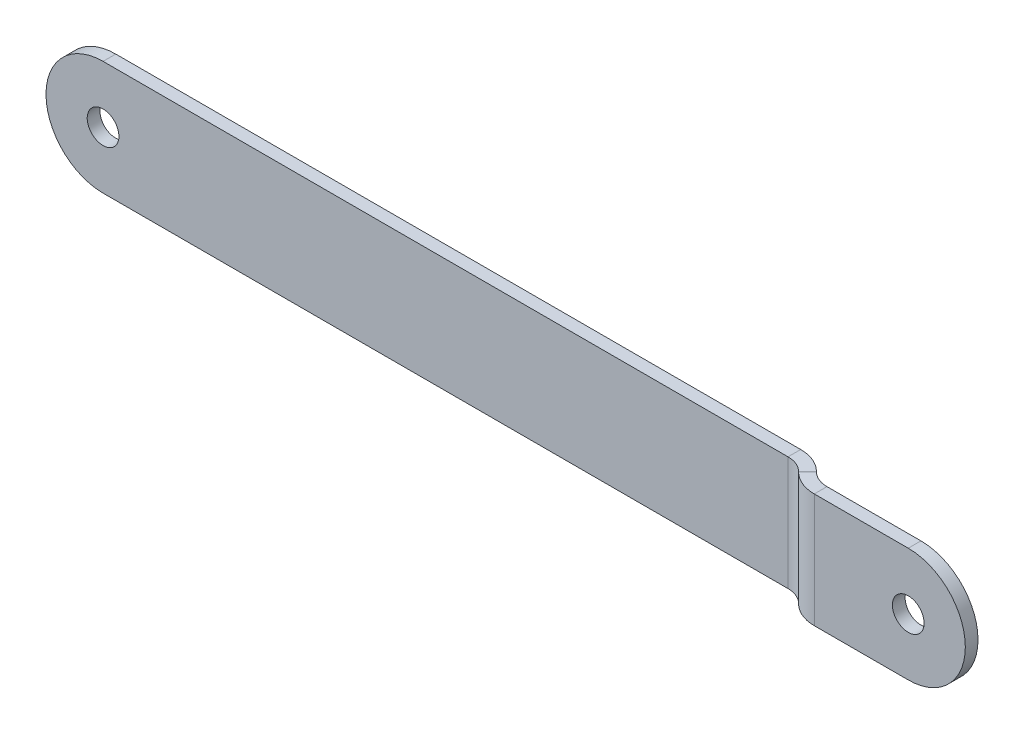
ISO-10303-21;
HEADER;
FILE_DESCRIPTION(('STEP AP214'),'2;1');
FILE_NAME('part.step','',(''),(''),'','','');
FILE_SCHEMA(('AUTOMOTIVE_DESIGN { 1 0 10303 214 1 1 1 1 }'));
ENDSEC;
DATA;
#1=APPLICATION_CONTEXT('core data for automotive mechanical design processes');
#2=APPLICATION_PROTOCOL_DEFINITION('international standard','automotive_design',2000,#1);
#3=PRODUCT_CONTEXT('',#1,'mechanical');
#4=PRODUCT('Part','Part','',(#3));
#5=PRODUCT_RELATED_PRODUCT_CATEGORY('part','',(#4));
#6=PRODUCT_DEFINITION_FORMATION('','',#4);
#7=PRODUCT_DEFINITION_CONTEXT('part definition',#1,'design');
#8=PRODUCT_DEFINITION('design','',#6,#7);
#9=PRODUCT_DEFINITION_SHAPE('','',#8);
#10=(LENGTH_UNIT() NAMED_UNIT(*) SI_UNIT(.MILLI.,.METRE.));
#11=(NAMED_UNIT(*) PLANE_ANGLE_UNIT() SI_UNIT($,.RADIAN.));
#12=(NAMED_UNIT(*) SI_UNIT($,.STERADIAN.) SOLID_ANGLE_UNIT());
#13=UNCERTAINTY_MEASURE_WITH_UNIT(LENGTH_MEASURE(1.E-05),#10,'distance_accuracy_value','');
#14=(GEOMETRIC_REPRESENTATION_CONTEXT(3) GLOBAL_UNCERTAINTY_ASSIGNED_CONTEXT((#13)) GLOBAL_UNIT_ASSIGNED_CONTEXT((#10,
#11,#12)) REPRESENTATION_CONTEXT('',''));
#15=CARTESIAN_POINT('',(0.,0.,0.));
#16=DIRECTION('',(0.,0.,1.));
#17=DIRECTION('',(1.,0.,0.));
#18=AXIS2_PLACEMENT_3D('',#15,#16,#17);
#19=CARTESIAN_POINT('',(-33.305215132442,0.,-75.9985739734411));
#20=DIRECTION('',(-0.707106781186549,0.,0.707106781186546));
#21=DIRECTION('',(0.707106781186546,0.,0.707106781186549));
#22=AXIS2_PLACEMENT_3D('',#19,#20,#21);
#23=PLANE('',#22);
#24=DIRECTION('',(0.707106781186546,0.,0.707106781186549));
#25=VECTOR('',#24,1.);
#26=CARTESIAN_POINT('',(-33.305215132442,-9.00000000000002,-75.9985739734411));
#27=LINE('',#26,#25);
#28=CARTESIAN_POINT('',(45.8649317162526,-9.,3.17157287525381));
#29=VERTEX_POINT('',#28);
#30=CARTESIAN_POINT('',(45.9359995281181,-9.,3.2426406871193));
#31=VERTEX_POINT('',#30);
#32=EDGE_CURVE('E46',#29,#31,#27,.T.);
#33=ORIENTED_EDGE('',*,*,#32,.T.);
#34=DIRECTION('',(0.,1.,0.));
#35=VECTOR('',#34,1.);
#36=CARTESIAN_POINT('',(45.9359995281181,0.,3.2426406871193));
#37=LINE('',#36,#35);
#38=CARTESIAN_POINT('',(45.9359995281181,9.00000000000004,3.2426406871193));
#39=VERTEX_POINT('',#38);
#40=EDGE_CURVE('E254',#31,#39,#37,.T.);
#41=ORIENTED_EDGE('',*,*,#40,.T.);
#42=DIRECTION('',(-0.707106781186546,0.,-0.707106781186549));
#43=VECTOR('',#42,1.);
#44=CARTESIAN_POINT('',(-33.305215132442,9.00000000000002,-75.9985739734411));
#45=LINE('',#44,#43);
#46=CARTESIAN_POINT('',(45.8649317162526,9.00000000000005,3.17157287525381));
#47=VERTEX_POINT('',#46);
#48=EDGE_CURVE('E263',#39,#47,#45,.T.);
#49=ORIENTED_EDGE('',*,*,#48,.T.);
#50=DIRECTION('',(0.,1.,0.));
#51=VECTOR('',#50,1.);
#52=CARTESIAN_POINT('',(45.8649317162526,0.,3.17157287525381));
#53=LINE('',#52,#51);
#54=EDGE_CURVE('E245',#29,#47,#53,.T.);
#55=ORIENTED_EDGE('',*,*,#54,.F.);
#56=EDGE_LOOP('',(#33,#41,#49,#55));
#57=FACE_BOUND('',#56,.T.);
#58=ADVANCED_FACE('F42',(#57),#23,.T.);
#59=CARTESIAN_POINT('',(-33.305215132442,9.00000000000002,-75.9985739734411));
#60=DIRECTION('',(0.,-1.,0.));
#61=DIRECTION('',(0.707106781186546,0.,0.707106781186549));
#62=AXIS2_PLACEMENT_3D('',#59,#60,#61);
#63=PLANE('',#62);
#64=DIRECTION('',(-0.707106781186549,0.,0.707106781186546));
#65=VECTOR('',#64,1.);
#66=CARTESIAN_POINT('',(45.9359995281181,9.00000000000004,3.2426406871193));
#67=LINE('',#66,#65);
#68=CARTESIAN_POINT('',(47.3502130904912,9.00000000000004,1.82842712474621));
#69=VERTEX_POINT('',#68);
#70=EDGE_CURVE('E12',#69,#39,#67,.T.);
#71=ORIENTED_EDGE('',*,*,#70,.F.);
#72=DIRECTION('',(-0.707106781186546,0.,-0.707106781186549));
#73=VECTOR('',#72,1.);
#74=CARTESIAN_POINT('',(-31.8910015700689,9.00000000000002,-77.4127875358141));
#75=LINE('',#74,#73);
#76=CARTESIAN_POINT('',(47.2791452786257,9.00000000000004,1.75735931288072));
#77=VERTEX_POINT('',#76);
#78=EDGE_CURVE('E59',#69,#77,#75,.T.);
#79=ORIENTED_EDGE('',*,*,#78,.T.);
#80=DIRECTION('',(-0.707106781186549,0.,0.707106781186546));
#81=VECTOR('',#80,1.);
#82=CARTESIAN_POINT('',(45.8649317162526,9.00000000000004,3.17157287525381));
#83=LINE('',#82,#81);
#84=EDGE_CURVE('E248',#77,#47,#83,.T.);
#85=ORIENTED_EDGE('',*,*,#84,.T.);
#86=ORIENTED_EDGE('',*,*,#48,.F.);
#87=EDGE_LOOP('',(#71,#79,#85,#86));
#88=FACE_BOUND('',#87,.T.);
#89=ADVANCED_FACE('F44',(#88),#63,.F.);
#90=CARTESIAN_POINT('',(-33.305215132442,-9.00000000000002,-75.9985739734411));
#91=DIRECTION('',(0.,1.,0.));
#92=DIRECTION('',(-0.707106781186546,0.,-0.707106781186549));
#93=AXIS2_PLACEMENT_3D('',#90,#91,#92);
#94=PLANE('',#93);
#95=DIRECTION('',(0.707106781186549,0.,-0.707106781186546));
#96=VECTOR('',#95,1.);
#97=CARTESIAN_POINT('',(45.9359995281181,-9.,3.2426406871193));
#98=LINE('',#97,#96);
#99=CARTESIAN_POINT('',(47.3502130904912,-9.,1.82842712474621));
#100=VERTEX_POINT('',#99);
#101=EDGE_CURVE('E257',#31,#100,#98,.T.);
#102=ORIENTED_EDGE('',*,*,#101,.F.);
#103=ORIENTED_EDGE('',*,*,#32,.F.);
#104=DIRECTION('',(0.707106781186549,0.,-0.707106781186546));
#105=VECTOR('',#104,1.);
#106=CARTESIAN_POINT('',(45.8649317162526,-9.,3.17157287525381));
#107=LINE('',#106,#105);
#108=CARTESIAN_POINT('',(47.2791452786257,-9.,1.75735931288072));
#109=VERTEX_POINT('',#108);
#110=EDGE_CURVE('E252',#29,#109,#107,.T.);
#111=ORIENTED_EDGE('',*,*,#110,.T.);
#112=DIRECTION('',(0.707106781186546,0.,0.707106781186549));
#113=VECTOR('',#112,1.);
#114=CARTESIAN_POINT('',(-31.8910015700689,-9.00000000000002,-77.4127875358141));
#115=LINE('',#114,#113);
#116=EDGE_CURVE('E67',#109,#100,#115,.T.);
#117=ORIENTED_EDGE('',*,*,#116,.T.);
#118=EDGE_LOOP('',(#102,#103,#111,#117));
#119=FACE_BOUND('',#118,.T.);
#120=ADVANCED_FACE('F269',(#119),#94,.F.);
#121=CARTESIAN_POINT('',(-31.8910015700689,0.,-77.4127875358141));
#122=DIRECTION('',(-0.707106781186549,0.,0.707106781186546));
#123=DIRECTION('',(0.707106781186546,0.,0.707106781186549));
#124=AXIS2_PLACEMENT_3D('',#121,#122,#123);
#125=PLANE('',#124);
#126=DIRECTION('',(0.,1.,0.));
#127=VECTOR('',#126,1.);
#128=CARTESIAN_POINT('',(47.3502130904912,0.,1.82842712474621));
#129=LINE('',#128,#127);
#130=EDGE_CURVE('E51',#100,#69,#129,.T.);
#131=ORIENTED_EDGE('',*,*,#130,.F.);
#132=ORIENTED_EDGE('',*,*,#116,.F.);
#133=DIRECTION('',(0.,1.,0.));
#134=VECTOR('',#133,1.);
#135=CARTESIAN_POINT('',(47.2791452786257,0.,1.75735931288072));
#136=LINE('',#135,#134);
#137=EDGE_CURVE('E250',#109,#77,#136,.T.);
#138=ORIENTED_EDGE('',*,*,#137,.T.);
#139=ORIENTED_EDGE('',*,*,#78,.F.);
#140=EDGE_LOOP('',(#131,#132,#138,#139));
#141=FACE_BOUND('',#140,.T.);
#142=ADVANCED_FACE('F289',(#141),#125,.F.);
#143=CARTESIAN_POINT('',(-65.,0.,2.));
#144=DIRECTION('',(0.,0.,-1.));
#145=DIRECTION('',(-1.,0.,0.));
#146=AXIS2_PLACEMENT_3D('',#143,#144,#145);
#147=CYLINDRICAL_SURFACE('',#146,9.00000000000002);
#148=CARTESIAN_POINT('',(-65.,0.,0.));
#149=DIRECTION('',(0.,0.,1.));
#150=DIRECTION('',(1.,0.,0.));
#151=AXIS2_PLACEMENT_3D('',#148,#149,#150);
#152=CIRCLE('',#151,9.00000000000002);
#153=CARTESIAN_POINT('',(-65.,9.00000000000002,0.));
#154=VERTEX_POINT('',#153);
#155=CARTESIAN_POINT('',(-65.,-9.00000000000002,0.));
#156=VERTEX_POINT('',#155);
#157=EDGE_CURVE('E234',#154,#156,#152,.T.);
#158=ORIENTED_EDGE('',*,*,#157,.T.);
#159=DIRECTION('',(0.,0.,-1.));
#160=VECTOR('',#159,1.);
#161=CARTESIAN_POINT('',(-65.,-9.00000000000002,2.));
#162=LINE('',#161,#160);
#163=CARTESIAN_POINT('',(-65.,-9.00000000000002,2.));
#164=VERTEX_POINT('',#163);
#165=EDGE_CURVE('E210',#164,#156,#162,.T.);
#166=ORIENTED_EDGE('',*,*,#165,.F.);
#167=CARTESIAN_POINT('',(-65.,0.,2.));
#168=DIRECTION('',(0.,0.,1.));
#169=DIRECTION('',(1.,0.,0.));
#170=AXIS2_PLACEMENT_3D('',#167,#168,#169);
#171=CIRCLE('',#170,9.00000000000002);
#172=CARTESIAN_POINT('',(-65.,9.00000000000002,2.));
#173=VERTEX_POINT('',#172);
#174=EDGE_CURVE('E218',#173,#164,#171,.T.);
#175=ORIENTED_EDGE('',*,*,#174,.F.);
#176=DIRECTION('',(0.,0.,-1.));
#177=VECTOR('',#176,1.);
#178=CARTESIAN_POINT('',(-65.,9.00000000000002,2.));
#179=LINE('',#178,#177);
#180=EDGE_CURVE('E231',#173,#154,#179,.T.);
#181=ORIENTED_EDGE('',*,*,#180,.T.);
#182=EDGE_LOOP('',(#158,#166,#175,#181));
#183=FACE_BOUND('',#182,.T.);
#184=ADVANCED_FACE('F321',(#183),#147,.T.);
#185=CARTESIAN_POINT('',(-65.,0.,2.));
#186=DIRECTION('',(0.,0.,-1.));
#187=DIRECTION('',(-1.,0.,0.));
#188=AXIS2_PLACEMENT_3D('',#185,#186,#187);
#189=CYLINDRICAL_SURFACE('',#188,2.5);
#190=CARTESIAN_POINT('',(-65.,0.,2.));
#191=DIRECTION('',(0.,0.,1.));
#192=DIRECTION('',(1.,0.,0.));
#193=AXIS2_PLACEMENT_3D('',#190,#191,#192);
#194=CIRCLE('',#193,2.5);
#195=CARTESIAN_POINT('',(-62.5,0.,2.));
#196=VERTEX_POINT('',#195);
#197=EDGE_CURVE('E228',#196,#196,#194,.T.);
#198=ORIENTED_EDGE('',*,*,#197,.T.);
#199=EDGE_LOOP('',(#198));
#200=FACE_BOUND('',#199,.T.);
#201=CARTESIAN_POINT('',(-65.,0.,0.));
#202=DIRECTION('',(0.,0.,1.));
#203=DIRECTION('',(1.,0.,0.));
#204=AXIS2_PLACEMENT_3D('',#201,#202,#203);
#205=CIRCLE('',#204,2.5);
#206=CARTESIAN_POINT('',(-62.5,0.,0.));
#207=VERTEX_POINT('',#206);
#208=EDGE_CURVE('E213',#207,#207,#205,.T.);
#209=ORIENTED_EDGE('',*,*,#208,.F.);
#210=EDGE_LOOP('',(#209));
#211=FACE_BOUND('',#210,.T.);
#212=ADVANCED_FACE('F324',(#200,#211),#189,.F.);
#213=CARTESIAN_POINT('',(-65.,0.,2.));
#214=DIRECTION('',(0.,0.,1.));
#215=DIRECTION('',(1.,0.,0.));
#216=AXIS2_PLACEMENT_3D('',#213,#214,#215);
#217=PLANE('',#216);
#218=ORIENTED_EDGE('',*,*,#197,.F.);
#219=EDGE_LOOP('',(#218));
#220=FACE_BOUND('',#219,.T.);
#221=DIRECTION('',(1.,0.,0.));
#222=VECTOR('',#221,1.);
#223=CARTESIAN_POINT('',(-65.,-9.00000000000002,2.));
#224=LINE('',#223,#222);
#225=CARTESIAN_POINT('',(43.0365045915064,-9.,2.));
#226=VERTEX_POINT('',#225);
#227=EDGE_CURVE('E226',#164,#226,#224,.T.);
#228=ORIENTED_EDGE('',*,*,#227,.T.);
#229=DIRECTION('',(0.,1.,0.));
#230=VECTOR('',#229,1.);
#231=CARTESIAN_POINT('',(43.0365045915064,0.,2.));
#232=LINE('',#231,#230);
#233=CARTESIAN_POINT('',(43.0365045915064,9.00000000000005,2.));
#234=VERTEX_POINT('',#233);
#235=EDGE_CURVE('E223',#226,#234,#232,.T.);
#236=ORIENTED_EDGE('',*,*,#235,.T.);
#237=DIRECTION('',(-1.,0.,0.));
#238=VECTOR('',#237,1.);
#239=CARTESIAN_POINT('',(-65.,9.00000000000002,2.));
#240=LINE('',#239,#238);
#241=EDGE_CURVE('E221',#234,#173,#240,.T.);
#242=ORIENTED_EDGE('',*,*,#241,.T.);
#243=ORIENTED_EDGE('',*,*,#174,.T.);
#244=EDGE_LOOP('',(#228,#236,#242,#243));
#245=FACE_BOUND('',#244,.T.);
#246=ADVANCED_FACE('F308',(#220,#245),#217,.T.);
#247=CARTESIAN_POINT('',(-65.,9.00000000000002,2.));
#248=DIRECTION('',(0.,-1.,0.));
#249=DIRECTION('',(1.,0.,0.));
#250=AXIS2_PLACEMENT_3D('',#247,#248,#249);
#251=PLANE('',#250);
#252=DIRECTION('',(0.,0.,1.));
#253=VECTOR('',#252,1.);
#254=CARTESIAN_POINT('',(43.0365045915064,9.00000000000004,2.));
#255=LINE('',#254,#253);
#256=CARTESIAN_POINT('',(43.0365045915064,9.00000000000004,0.));
#257=VERTEX_POINT('',#256);
#258=EDGE_CURVE('E237',#257,#234,#255,.T.);
#259=ORIENTED_EDGE('',*,*,#258,.F.);
#260=DIRECTION('',(-1.,0.,0.));
#261=VECTOR('',#260,1.);
#262=CARTESIAN_POINT('',(-65.,9.00000000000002,0.));
#263=LINE('',#262,#261);
#264=EDGE_CURVE('E216',#257,#154,#263,.T.);
#265=ORIENTED_EDGE('',*,*,#264,.T.);
#266=ORIENTED_EDGE('',*,*,#180,.F.);
#267=ORIENTED_EDGE('',*,*,#241,.F.);
#268=EDGE_LOOP('',(#259,#265,#266,#267));
#269=FACE_BOUND('',#268,.T.);
#270=ADVANCED_FACE('F314',(#269),#251,.F.);
#271=CARTESIAN_POINT('',(-65.,0.,0.));
#272=DIRECTION('',(0.,0.,1.));
#273=DIRECTION('',(1.,0.,0.));
#274=AXIS2_PLACEMENT_3D('',#271,#272,#273);
#275=PLANE('',#274);
#276=DIRECTION('',(0.,1.,0.));
#277=VECTOR('',#276,1.);
#278=CARTESIAN_POINT('',(43.0365045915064,0.,0.));
#279=LINE('',#278,#277);
#280=CARTESIAN_POINT('',(43.0365045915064,-9.,0.));
#281=VERTEX_POINT('',#280);
#282=EDGE_CURVE('E240',#281,#257,#279,.T.);
#283=ORIENTED_EDGE('',*,*,#282,.F.);
#284=DIRECTION('',(1.,0.,0.));
#285=VECTOR('',#284,1.);
#286=CARTESIAN_POINT('',(-65.,-9.00000000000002,0.));
#287=LINE('',#286,#285);
#288=EDGE_CURVE('E208',#156,#281,#287,.T.);
#289=ORIENTED_EDGE('',*,*,#288,.F.);
#290=ORIENTED_EDGE('',*,*,#157,.F.);
#291=ORIENTED_EDGE('',*,*,#264,.F.);
#292=EDGE_LOOP('',(#283,#289,#290,#291));
#293=FACE_BOUND('',#292,.T.);
#294=ORIENTED_EDGE('',*,*,#208,.T.);
#295=EDGE_LOOP('',(#294));
#296=FACE_BOUND('',#295,.T.);
#297=ADVANCED_FACE('F316',(#293,#296),#275,.F.);
#298=CARTESIAN_POINT('',(-65.,-9.00000000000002,2.));
#299=DIRECTION('',(0.,1.,0.));
#300=DIRECTION('',(-1.,0.,0.));
#301=AXIS2_PLACEMENT_3D('',#298,#299,#300);
#302=PLANE('',#301);
#303=DIRECTION('',(0.,0.,-1.));
#304=VECTOR('',#303,1.);
#305=CARTESIAN_POINT('',(43.0365045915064,-9.,2.));
#306=LINE('',#305,#304);
#307=EDGE_CURVE('E203',#226,#281,#306,.T.);
#308=ORIENTED_EDGE('',*,*,#307,.F.);
#309=ORIENTED_EDGE('',*,*,#227,.F.);
#310=ORIENTED_EDGE('',*,*,#165,.T.);
#311=ORIENTED_EDGE('',*,*,#288,.T.);
#312=EDGE_LOOP('',(#308,#309,#310,#311));
#313=FACE_BOUND('',#312,.T.);
#314=ADVANCED_FACE('F302',(#313),#302,.F.);
#315=CARTESIAN_POINT('',(43.0365045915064,-9.,6.));
#316=DIRECTION('',(0.,1.,0.));
#317=DIRECTION('',(0.,0.,1.));
#318=AXIS2_PLACEMENT_3D('',#315,#316,#317);
#319=PLANE('',#318);
#320=ORIENTED_EDGE('',*,*,#307,.T.);
#321=CARTESIAN_POINT('',(43.0365045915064,-9.,6.));
#322=DIRECTION('',(0.,1.,0.));
#323=DIRECTION('',(0.,0.,1.));
#324=AXIS2_PLACEMENT_3D('',#321,#322,#323);
#325=CIRCLE('',#324,6.);
#326=EDGE_CURVE('E192',#281,#109,#325,.F.);
#327=ORIENTED_EDGE('',*,*,#326,.T.);
#328=ORIENTED_EDGE('',*,*,#110,.F.);
#329=CARTESIAN_POINT('',(43.0365045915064,-9.,6.));
#330=DIRECTION('',(0.,-1.,0.));
#331=DIRECTION('',(0.,0.,-1.));
#332=AXIS2_PLACEMENT_3D('',#329,#330,#331);
#333=CIRCLE('',#332,4.);
#334=EDGE_CURVE('E196',#226,#29,#333,.T.);
#335=ORIENTED_EDGE('',*,*,#334,.F.);
#336=EDGE_LOOP('',(#320,#327,#328,#335));
#337=FACE_BOUND('',#336,.T.);
#338=ADVANCED_FACE('F298',(#337),#319,.F.);
#339=CARTESIAN_POINT('',(43.0365045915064,9.00000000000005,6.));
#340=DIRECTION('',(0.,-1.,0.));
#341=DIRECTION('',(0.,0.,-1.));
#342=AXIS2_PLACEMENT_3D('',#339,#340,#341);
#343=PLANE('',#342);
#344=CARTESIAN_POINT('',(43.0365045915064,9.00000000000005,6.));
#345=DIRECTION('',(0.,1.,0.));
#346=DIRECTION('',(0.,0.,1.));
#347=AXIS2_PLACEMENT_3D('',#344,#345,#346);
#348=CIRCLE('',#347,6.);
#349=EDGE_CURVE('E200',#77,#257,#348,.T.);
#350=ORIENTED_EDGE('',*,*,#349,.T.);
#351=ORIENTED_EDGE('',*,*,#258,.T.);
#352=CARTESIAN_POINT('',(43.0365045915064,9.00000000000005,6.));
#353=DIRECTION('',(0.,1.,0.));
#354=DIRECTION('',(0.,0.,1.));
#355=AXIS2_PLACEMENT_3D('',#352,#353,#354);
#356=CIRCLE('',#355,4.);
#357=EDGE_CURVE('E199',#47,#234,#356,.T.);
#358=ORIENTED_EDGE('',*,*,#357,.F.);
#359=ORIENTED_EDGE('',*,*,#84,.F.);
#360=EDGE_LOOP('',(#350,#351,#358,#359));
#361=FACE_BOUND('',#360,.T.);
#362=ADVANCED_FACE('F312',(#361),#343,.F.);
#363=CARTESIAN_POINT('',(43.0365045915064,-18.5316285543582,6.));
#364=DIRECTION('',(0.,1.,0.));
#365=DIRECTION('',(0.,0.,1.));
#366=AXIS2_PLACEMENT_3D('',#363,#364,#365);
#367=CYLINDRICAL_SURFACE('',#366,4.);
#368=ORIENTED_EDGE('',*,*,#54,.T.);
#369=ORIENTED_EDGE('',*,*,#357,.T.);
#370=ORIENTED_EDGE('',*,*,#235,.F.);
#371=ORIENTED_EDGE('',*,*,#334,.T.);
#372=EDGE_LOOP('',(#368,#369,#370,#371));
#373=FACE_BOUND('',#372,.T.);
#374=ADVANCED_FACE('F305',(#373),#367,.F.);
#375=CARTESIAN_POINT('',(43.0365045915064,-18.5316285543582,6.));
#376=DIRECTION('',(0.,1.,0.));
#377=DIRECTION('',(0.,0.,1.));
#378=AXIS2_PLACEMENT_3D('',#375,#376,#377);
#379=CYLINDRICAL_SURFACE('',#378,6.);
#380=ORIENTED_EDGE('',*,*,#137,.F.);
#381=ORIENTED_EDGE('',*,*,#326,.F.);
#382=ORIENTED_EDGE('',*,*,#282,.T.);
#383=ORIENTED_EDGE('',*,*,#349,.F.);
#384=EDGE_LOOP('',(#380,#381,#382,#383));
#385=FACE_BOUND('',#384,.T.);
#386=ADVANCED_FACE('F297',(#385),#379,.T.);
#387=CARTESIAN_POINT('',(50.1786402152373,-9.,-0.999999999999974));
#388=DIRECTION('',(0.,-1.,0.));
#389=DIRECTION('',(0.,0.,-1.));
#390=AXIS2_PLACEMENT_3D('',#387,#388,#389);
#391=PLANE('',#390);
#392=ORIENTED_EDGE('',*,*,#101,.T.);
#393=CARTESIAN_POINT('',(50.1786402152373,-9.,-0.999999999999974));
#394=DIRECTION('',(0.,1.,0.));
#395=DIRECTION('',(0.,0.,1.));
#396=AXIS2_PLACEMENT_3D('',#393,#394,#395);
#397=CIRCLE('',#396,4.);
#398=CARTESIAN_POINT('',(50.1786402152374,-9.,3.00000000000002));
#399=VERTEX_POINT('',#398);
#400=EDGE_CURVE('E159',#100,#399,#397,.T.);
#401=ORIENTED_EDGE('',*,*,#400,.T.);
#402=DIRECTION('',(0.,0.,-1.));
#403=VECTOR('',#402,1.);
#404=CARTESIAN_POINT('',(50.1786402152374,-9.,5.00000000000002));
#405=LINE('',#404,#403);
#406=CARTESIAN_POINT('',(50.1786402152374,-9.,5.00000000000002));
#407=VERTEX_POINT('',#406);
#408=EDGE_CURVE('E143',#407,#399,#405,.T.);
#409=ORIENTED_EDGE('',*,*,#408,.F.);
#410=CARTESIAN_POINT('',(50.1786402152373,-9.,-0.999999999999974));
#411=DIRECTION('',(0.,1.,0.));
#412=DIRECTION('',(0.,0.,1.));
#413=AXIS2_PLACEMENT_3D('',#410,#411,#412);
#414=CIRCLE('',#413,6.);
#415=EDGE_CURVE('E187',#31,#407,#414,.T.);
#416=ORIENTED_EDGE('',*,*,#415,.F.);
#417=EDGE_LOOP('',(#392,#401,#409,#416));
#418=FACE_BOUND('',#417,.T.);
#419=ADVANCED_FACE('F277',(#418),#391,.T.);
#420=CARTESIAN_POINT('',(50.1786402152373,9.00000000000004,-0.999999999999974));
#421=DIRECTION('',(0.,1.,0.));
#422=DIRECTION('',(0.,0.,1.));
#423=AXIS2_PLACEMENT_3D('',#420,#421,#422);
#424=PLANE('',#423);
#425=CARTESIAN_POINT('',(50.1786402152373,9.00000000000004,-0.999999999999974));
#426=DIRECTION('',(0.,1.,0.));
#427=DIRECTION('',(0.,0.,1.));
#428=AXIS2_PLACEMENT_3D('',#425,#426,#427);
#429=CIRCLE('',#428,4.);
#430=CARTESIAN_POINT('',(50.1786402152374,9.00000000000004,3.00000000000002));
#431=VERTEX_POINT('',#430);
#432=EDGE_CURVE('E162',#431,#69,#429,.F.);
#433=ORIENTED_EDGE('',*,*,#432,.T.);
#434=ORIENTED_EDGE('',*,*,#70,.T.);
#435=CARTESIAN_POINT('',(50.1786402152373,9.00000000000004,-0.999999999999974));
#436=DIRECTION('',(0.,-1.,0.));
#437=DIRECTION('',(0.,0.,-1.));
#438=AXIS2_PLACEMENT_3D('',#435,#436,#437);
#439=CIRCLE('',#438,6.);
#440=CARTESIAN_POINT('',(50.1786402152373,9.00000000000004,5.00000000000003));
#441=VERTEX_POINT('',#440);
#442=EDGE_CURVE('E190',#441,#39,#439,.T.);
#443=ORIENTED_EDGE('',*,*,#442,.F.);
#444=DIRECTION('',(0.,0.,1.));
#445=VECTOR('',#444,1.);
#446=CARTESIAN_POINT('',(50.1786402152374,9.00000000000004,5.00000000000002));
#447=LINE('',#446,#445);
#448=EDGE_CURVE('E140',#431,#441,#447,.T.);
#449=ORIENTED_EDGE('',*,*,#448,.F.);
#450=EDGE_LOOP('',(#433,#434,#443,#449));
#451=FACE_BOUND('',#450,.T.);
#452=ADVANCED_FACE('F287',(#451),#424,.T.);
#453=CARTESIAN_POINT('',(50.1786402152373,-18.950705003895,-0.999999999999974));
#454=DIRECTION('',(0.,1.,0.));
#455=DIRECTION('',(0.,0.,1.));
#456=AXIS2_PLACEMENT_3D('',#453,#454,#455);
#457=CYLINDRICAL_SURFACE('',#456,6.);
#458=DIRECTION('',(0.,1.,0.));
#459=VECTOR('',#458,1.);
#460=CARTESIAN_POINT('',(50.1786402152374,0.,5.00000000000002));
#461=LINE('',#460,#459);
#462=EDGE_CURVE('E185',#407,#441,#461,.T.);
#463=ORIENTED_EDGE('',*,*,#462,.T.);
#464=ORIENTED_EDGE('',*,*,#442,.T.);
#465=ORIENTED_EDGE('',*,*,#40,.F.);
#466=ORIENTED_EDGE('',*,*,#415,.T.);
#467=EDGE_LOOP('',(#463,#464,#465,#466));
#468=FACE_BOUND('',#467,.T.);
#469=ADVANCED_FACE('F274',(#468),#457,.T.);
#470=CARTESIAN_POINT('',(50.1786402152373,-18.950705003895,-0.999999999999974));
#471=DIRECTION('',(0.,1.,0.));
#472=DIRECTION('',(0.,0.,1.));
#473=AXIS2_PLACEMENT_3D('',#470,#471,#472);
#474=CYLINDRICAL_SURFACE('',#473,4.);
#475=DIRECTION('',(0.,1.,0.));
#476=VECTOR('',#475,1.);
#477=CARTESIAN_POINT('',(50.1786402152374,0.,3.00000000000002));
#478=LINE('',#477,#476);
#479=EDGE_CURVE('E168',#399,#431,#478,.T.);
#480=ORIENTED_EDGE('',*,*,#479,.F.);
#481=ORIENTED_EDGE('',*,*,#400,.F.);
#482=ORIENTED_EDGE('',*,*,#130,.T.);
#483=ORIENTED_EDGE('',*,*,#432,.F.);
#484=EDGE_LOOP('',(#480,#481,#482,#483));
#485=FACE_BOUND('',#484,.T.);
#486=ADVANCED_FACE('F283',(#485),#474,.F.);
#487=CARTESIAN_POINT('',(65.,0.,5.00000000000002));
#488=DIRECTION('',(0.,0.,-1.));
#489=DIRECTION('',(-1.,0.,0.));
#490=AXIS2_PLACEMENT_3D('',#487,#488,#489);
#491=CYLINDRICAL_SURFACE('',#490,2.5);
#492=CARTESIAN_POINT('',(65.,0.,5.00000000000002));
#493=DIRECTION('',(0.,0.,1.));
#494=DIRECTION('',(1.,0.,0.));
#495=AXIS2_PLACEMENT_3D('',#492,#493,#494);
#496=CIRCLE('',#495,2.5);
#497=CARTESIAN_POINT('',(67.5,0.,5.00000000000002));
#498=VERTEX_POINT('',#497);
#499=EDGE_CURVE('E182',#498,#498,#496,.T.);
#500=ORIENTED_EDGE('',*,*,#499,.T.);
#501=EDGE_LOOP('',(#500));
#502=FACE_BOUND('',#501,.T.);
#503=CARTESIAN_POINT('',(65.,0.,3.00000000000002));
#504=DIRECTION('',(0.,0.,1.));
#505=DIRECTION('',(1.,0.,0.));
#506=AXIS2_PLACEMENT_3D('',#503,#504,#505);
#507=CIRCLE('',#506,2.5);
#508=CARTESIAN_POINT('',(67.5,0.,3.00000000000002));
#509=VERTEX_POINT('',#508);
#510=EDGE_CURVE('E171',#509,#509,#507,.T.);
#511=ORIENTED_EDGE('',*,*,#510,.F.);
#512=EDGE_LOOP('',(#511));
#513=FACE_BOUND('',#512,.T.);
#514=ADVANCED_FACE('F469',(#502,#513),#491,.F.);
#515=CARTESIAN_POINT('',(65.,0.,5.00000000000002));
#516=DIRECTION('',(0.,0.,-1.));
#517=DIRECTION('',(-1.,0.,0.));
#518=AXIS2_PLACEMENT_3D('',#515,#516,#517);
#519=CYLINDRICAL_SURFACE('',#518,9.00000000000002);
#520=CARTESIAN_POINT('',(65.,0.,3.00000000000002));
#521=DIRECTION('',(0.,0.,1.));
#522=DIRECTION('',(1.,0.,0.));
#523=AXIS2_PLACEMENT_3D('',#520,#521,#522);
#524=CIRCLE('',#523,9.00000000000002);
#525=CARTESIAN_POINT('',(65.,-9.,3.00000000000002));
#526=VERTEX_POINT('',#525);
#527=CARTESIAN_POINT('',(65.,9.00000000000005,3.00000000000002));
#528=VERTEX_POINT('',#527);
#529=EDGE_CURVE('E158',#526,#528,#524,.T.);
#530=ORIENTED_EDGE('',*,*,#529,.T.);
#531=DIRECTION('',(0.,0.,-1.));
#532=VECTOR('',#531,1.);
#533=CARTESIAN_POINT('',(65.,9.00000000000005,5.00000000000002));
#534=LINE('',#533,#532);
#535=CARTESIAN_POINT('',(65.,9.00000000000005,5.00000000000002));
#536=VERTEX_POINT('',#535);
#537=EDGE_CURVE('E138',#536,#528,#534,.T.);
#538=ORIENTED_EDGE('',*,*,#537,.F.);
#539=CARTESIAN_POINT('',(65.,0.,5.00000000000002));
#540=DIRECTION('',(0.,0.,1.));
#541=DIRECTION('',(1.,0.,0.));
#542=AXIS2_PLACEMENT_3D('',#539,#540,#541);
#543=CIRCLE('',#542,9.00000000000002);
#544=CARTESIAN_POINT('',(65.,-9.,5.00000000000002));
#545=VERTEX_POINT('',#544);
#546=EDGE_CURVE('E144',#545,#536,#543,.T.);
#547=ORIENTED_EDGE('',*,*,#546,.F.);
#548=DIRECTION('',(0.,0.,-1.));
#549=VECTOR('',#548,1.);
#550=CARTESIAN_POINT('',(65.,-9.,5.00000000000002));
#551=LINE('',#550,#549);
#552=EDGE_CURVE('E179',#545,#526,#551,.T.);
#553=ORIENTED_EDGE('',*,*,#552,.T.);
#554=EDGE_LOOP('',(#530,#538,#547,#553));
#555=FACE_BOUND('',#554,.T.);
#556=ADVANCED_FACE('F156',(#555),#519,.T.);
#557=CARTESIAN_POINT('',(-65.8123510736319,0.,5.00000000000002));
#558=DIRECTION('',(0.,0.,1.));
#559=DIRECTION('',(1.,0.,0.));
#560=AXIS2_PLACEMENT_3D('',#557,#558,#559);
#561=PLANE('',#560);
#562=ORIENTED_EDGE('',*,*,#462,.F.);
#563=DIRECTION('',(1.,0.,0.));
#564=VECTOR('',#563,1.);
#565=CARTESIAN_POINT('',(-65.8123510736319,-9.00000000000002,5.00000000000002));
#566=LINE('',#565,#564);
#567=EDGE_CURVE('E150',#407,#545,#566,.T.);
#568=ORIENTED_EDGE('',*,*,#567,.T.);
#569=ORIENTED_EDGE('',*,*,#546,.T.);
#570=DIRECTION('',(-1.,0.,0.));
#571=VECTOR('',#570,1.);
#572=CARTESIAN_POINT('',(-65.8123510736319,9.00000000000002,5.00000000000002));
#573=LINE('',#572,#571);
#574=EDGE_CURVE('E134',#536,#441,#573,.T.);
#575=ORIENTED_EDGE('',*,*,#574,.T.);
#576=EDGE_LOOP('',(#562,#568,#569,#575));
#577=FACE_BOUND('',#576,.T.);
#578=ORIENTED_EDGE('',*,*,#499,.F.);
#579=EDGE_LOOP('',(#578));
#580=FACE_BOUND('',#579,.T.);
#581=ADVANCED_FACE('F147',(#577,#580),#561,.T.);
#582=CARTESIAN_POINT('',(-65.8123510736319,-9.00000000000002,5.00000000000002));
#583=DIRECTION('',(0.,1.,0.));
#584=DIRECTION('',(-1.,0.,0.));
#585=AXIS2_PLACEMENT_3D('',#582,#583,#584);
#586=PLANE('',#585);
#587=ORIENTED_EDGE('',*,*,#567,.F.);
#588=ORIENTED_EDGE('',*,*,#408,.T.);
#589=DIRECTION('',(1.,0.,0.));
#590=VECTOR('',#589,1.);
#591=CARTESIAN_POINT('',(-65.8123510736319,-9.00000000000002,3.00000000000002));
#592=LINE('',#591,#590);
#593=EDGE_CURVE('E174',#399,#526,#592,.T.);
#594=ORIENTED_EDGE('',*,*,#593,.T.);
#595=ORIENTED_EDGE('',*,*,#552,.F.);
#596=EDGE_LOOP('',(#587,#588,#594,#595));
#597=FACE_BOUND('',#596,.T.);
#598=ADVANCED_FACE('F280',(#597),#586,.F.);
#599=CARTESIAN_POINT('',(-65.8123510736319,0.,3.00000000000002));
#600=DIRECTION('',(0.,0.,1.));
#601=DIRECTION('',(1.,0.,0.));
#602=AXIS2_PLACEMENT_3D('',#599,#600,#601);
#603=PLANE('',#602);
#604=ORIENTED_EDGE('',*,*,#510,.T.);
#605=EDGE_LOOP('',(#604));
#606=FACE_BOUND('',#605,.T.);
#607=ORIENTED_EDGE('',*,*,#593,.F.);
#608=ORIENTED_EDGE('',*,*,#479,.T.);
#609=DIRECTION('',(-1.,0.,0.));
#610=VECTOR('',#609,1.);
#611=CARTESIAN_POINT('',(-65.8123510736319,9.00000000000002,3.00000000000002));
#612=LINE('',#611,#610);
#613=EDGE_CURVE('E164',#528,#431,#612,.T.);
#614=ORIENTED_EDGE('',*,*,#613,.F.);
#615=ORIENTED_EDGE('',*,*,#529,.F.);
#616=EDGE_LOOP('',(#607,#608,#614,#615));
#617=FACE_BOUND('',#616,.T.);
#618=ADVANCED_FACE('F285',(#606,#617),#603,.F.);
#619=CARTESIAN_POINT('',(-65.8123510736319,9.00000000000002,5.00000000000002));
#620=DIRECTION('',(0.,-1.,0.));
#621=DIRECTION('',(1.,0.,0.));
#622=AXIS2_PLACEMENT_3D('',#619,#620,#621);
#623=PLANE('',#622);
#624=ORIENTED_EDGE('',*,*,#613,.T.);
#625=ORIENTED_EDGE('',*,*,#448,.T.);
#626=ORIENTED_EDGE('',*,*,#574,.F.);
#627=ORIENTED_EDGE('',*,*,#537,.T.);
#628=EDGE_LOOP('',(#624,#625,#626,#627));
#629=FACE_BOUND('',#628,.T.);
#630=ADVANCED_FACE('F136',(#629),#623,.F.);
#631=CLOSED_SHELL('',(#58,#89,#120,#142,#184,#212,#246,#270,#297,#314,#338,#362,#374,#386,#419,
#452,#469,#486,#514,#556,#581,#598,#618,#630));
#632=MANIFOLD_SOLID_BREP('B2',#631);
#633=ADVANCED_BREP_SHAPE_REPRESENTATION('',(#18,#632),#14);
#634=SHAPE_DEFINITION_REPRESENTATION(#9,#633);
ENDSEC;
END-ISO-10303-21;
